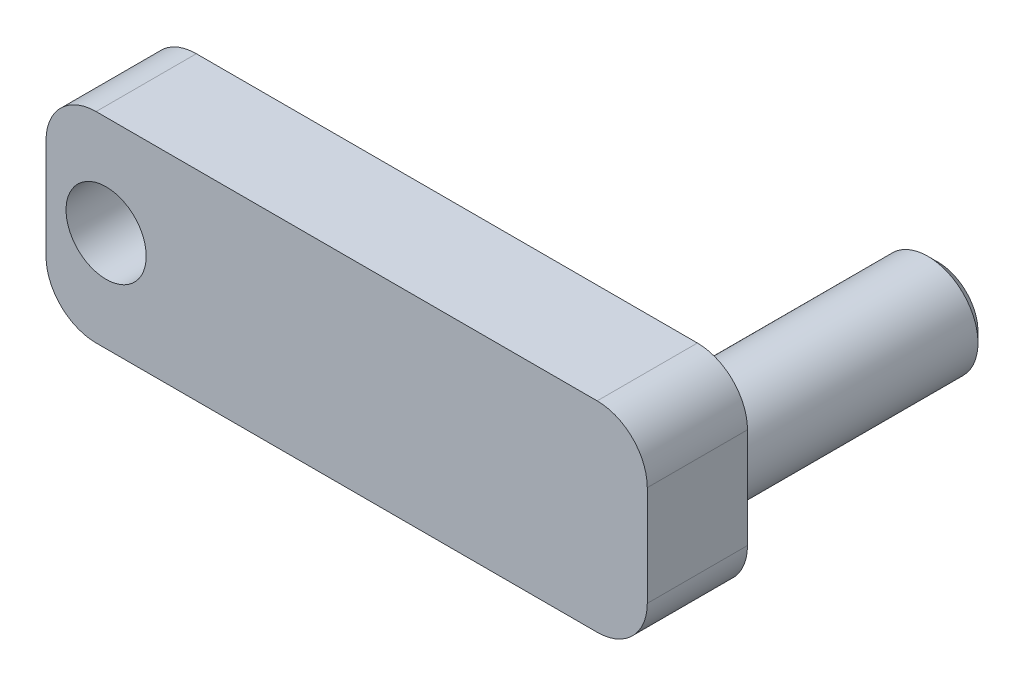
from build123d import *

# Parameters (mm, degrees)
EXTRUIR1_DEPTH        = 10
CROQUIS2_R            = 5
EXTRUIR2_DEPTH        = 25
CROQUIS3_R            = 4
CORTAR_EXTRUIR1_DEPTH = 40
CHAFL_N2_SIZE         = 1


with BuildPart() as part:
    # Croquis1 → Extruir1 (new body)
    with BuildSketch(Plane.XY):
        with BuildLine():
            Line((-20, 10), (30, 10))
            ThreePointArc((30, 10), (33.535533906, 8.535533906), (35, 5))
            Line((35, 5), (35, -5))
            ThreePointArc((35, -5), (33.535533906, -8.535533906), (30, -10))
            Line((30, -10), (-20, -10))
            ThreePointArc((-20, -10), (-23.535533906, -8.535533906), (-25, -5))
            Line((-25, -5), (-25, 5))
            ThreePointArc((-25, 5), (-23.535533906, 8.535533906), (-20, 10))
        make_face()
    extrude(amount=EXTRUIR1_DEPTH)

    # Croquis2 → Extruir2 (add)
    with BuildSketch(Plane(origin=(0, 0, 0), x_dir=(-1, 0, 0), z_dir=(0, 0, -1))):
        with Locations((-29, 0)):
            Circle(CROQUIS2_R)
    extrude(amount=EXTRUIR2_DEPTH)

    # Croquis3 → Cortar-Extruir1 (cut)
    with BuildSketch(Plane.XY.offset(10)):
        with Locations((-19, 0)):
            Circle(CROQUIS3_R)
    extrude(amount=-CORTAR_EXTRUIR1_DEPTH, mode=Mode.SUBTRACT)

    # Chafl_n2
    chafl_n2_edges = [part.edges().sort_by_distance(p)[0] for p in [
        (34, 0, -25),
    ]]
    chamfer(chafl_n2_edges, length=CHAFL_N2_SIZE)


solid = part.part
